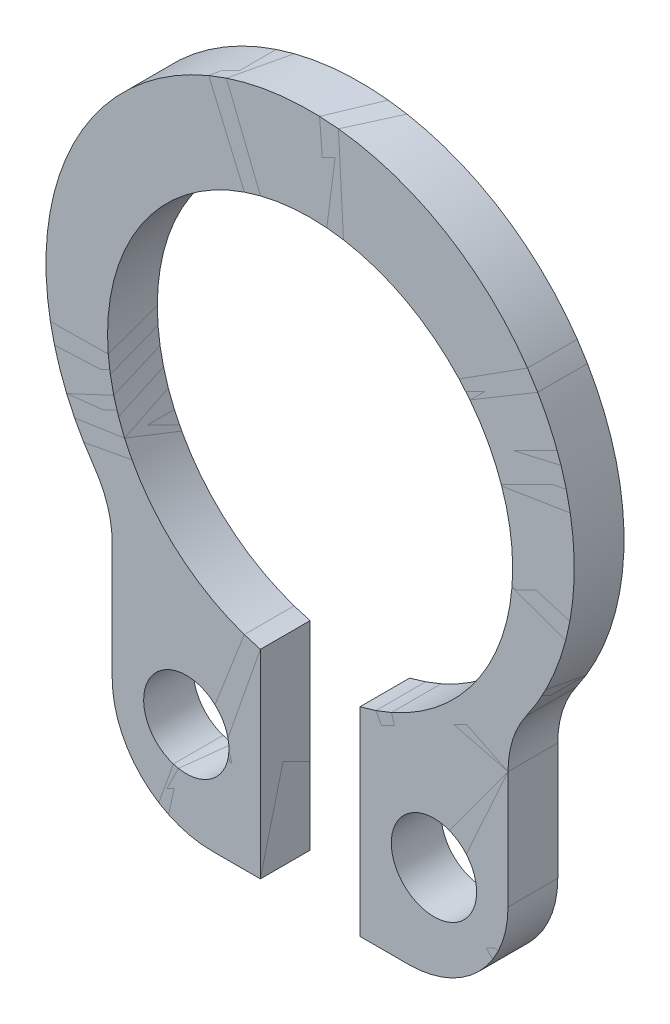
ISO-10303-21;
HEADER;
FILE_DESCRIPTION(('STEP AP214'),'2;1');
FILE_NAME('part.step','',(''),(''),'','','');
FILE_SCHEMA(('AUTOMOTIVE_DESIGN { 1 0 10303 214 1 1 1 1 }'));
ENDSEC;
DATA;
#1=APPLICATION_CONTEXT('core data for automotive mechanical design processes');
#2=APPLICATION_PROTOCOL_DEFINITION('international standard','automotive_design',2000,#1);
#3=PRODUCT_CONTEXT('',#1,'mechanical');
#4=PRODUCT('Part','Part','',(#3));
#5=PRODUCT_RELATED_PRODUCT_CATEGORY('part','',(#4));
#6=PRODUCT_DEFINITION_FORMATION('','',#4);
#7=PRODUCT_DEFINITION_CONTEXT('part definition',#1,'design');
#8=PRODUCT_DEFINITION('design','',#6,#7);
#9=PRODUCT_DEFINITION_SHAPE('','',#8);
#10=(LENGTH_UNIT() NAMED_UNIT(*) SI_UNIT(.MILLI.,.METRE.));
#11=(NAMED_UNIT(*) PLANE_ANGLE_UNIT() SI_UNIT($,.RADIAN.));
#12=(NAMED_UNIT(*) SI_UNIT($,.STERADIAN.) SOLID_ANGLE_UNIT());
#13=UNCERTAINTY_MEASURE_WITH_UNIT(LENGTH_MEASURE(1.E-05),#10,'distance_accuracy_value','');
#14=(GEOMETRIC_REPRESENTATION_CONTEXT(3) GLOBAL_UNCERTAINTY_ASSIGNED_CONTEXT((#13)) GLOBAL_UNIT_ASSIGNED_CONTEXT((#10,
#11,#12)) REPRESENTATION_CONTEXT('',''));
#15=CARTESIAN_POINT('',(0.,0.,0.));
#16=DIRECTION('',(0.,0.,1.));
#17=DIRECTION('',(1.,0.,0.));
#18=AXIS2_PLACEMENT_3D('',#15,#16,#17);
#19=CARTESIAN_POINT('',(-4.18444284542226,-2.51127459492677,0.7));
#20=DIRECTION('',(0.,0.,-1.));
#21=DIRECTION('',(-1.,0.,0.));
#22=AXIS2_PLACEMENT_3D('',#19,#20,#21);
#23=CYLINDRICAL_SURFACE('',#22,1.4);
#24=CARTESIAN_POINT('',(-4.18444284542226,-2.51127459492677,0.));
#25=DIRECTION('',(0.,0.,1.));
#26=DIRECTION('',(1.,0.,0.));
#27=AXIS2_PLACEMENT_3D('',#24,#25,#26);
#28=CIRCLE('',#27,1.4);
#29=CARTESIAN_POINT('',(-2.78444284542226,-2.51127459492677,0.));
#30=VERTEX_POINT('',#29);
#31=CARTESIAN_POINT('',(-3.03951385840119,-1.70558382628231,0.));
#32=VERTEX_POINT('',#31);
#33=EDGE_CURVE('P0_E459',#30,#32,#28,.T.);
#34=ORIENTED_EDGE('',*,*,#33,.F.);
#35=DIRECTION('',(0.,0.,-1.));
#36=VECTOR('',#35,1.);
#37=CARTESIAN_POINT('',(-2.78444284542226,-2.51127459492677,0.7));
#38=LINE('',#37,#36);
#39=CARTESIAN_POINT('',(-2.78444284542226,-2.51127459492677,0.7));
#40=VERTEX_POINT('',#39);
#41=EDGE_CURVE('P0_E364',#40,#30,#38,.T.);
#42=ORIENTED_EDGE('',*,*,#41,.F.);
#43=CARTESIAN_POINT('',(-4.18444284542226,-2.51127459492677,0.7));
#44=DIRECTION('',(0.,0.,1.));
#45=DIRECTION('',(1.,0.,0.));
#46=AXIS2_PLACEMENT_3D('',#43,#44,#45);
#47=CIRCLE('',#46,1.4);
#48=CARTESIAN_POINT('',(-3.03951385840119,-1.70558382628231,0.7));
#49=VERTEX_POINT('',#48);
#50=EDGE_CURVE('P0_E489',#40,#49,#47,.T.);
#51=ORIENTED_EDGE('',*,*,#50,.T.);
#52=DIRECTION('',(0.,0.,-1.));
#53=VECTOR('',#52,1.);
#54=CARTESIAN_POINT('',(-3.03951385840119,-1.70558382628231,0.7));
#55=LINE('',#54,#53);
#56=EDGE_CURVE('P0_E11',#49,#32,#55,.T.);
#57=ORIENTED_EDGE('',*,*,#56,.T.);
#58=EDGE_LOOP('',(#34,#42,#51,#57));
#59=FACE_BOUND('',#58,.T.);
#60=ADVANCED_FACE('P0_F350',(#59),#23,.F.);
#61=CARTESIAN_POINT('',(0.,0.433333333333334,0.7));
#62=DIRECTION('',(0.,0.,-1.));
#63=DIRECTION('',(-1.,0.,0.));
#64=AXIS2_PLACEMENT_3D('',#61,#62,#63);
#65=CYLINDRICAL_SURFACE('',#64,3.71666666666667);
#66=CARTESIAN_POINT('',(0.,0.433333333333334,0.));
#67=DIRECTION('',(0.,0.,1.));
#68=DIRECTION('',(1.,0.,0.));
#69=AXIS2_PLACEMENT_3D('',#66,#67,#68);
#70=CIRCLE('',#69,3.71666666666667);
#71=CARTESIAN_POINT('',(3.03951385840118,-1.70558382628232,0.));
#72=VERTEX_POINT('',#71);
#73=EDGE_CURVE('P0_E441',#72,#32,#70,.T.);
#74=ORIENTED_EDGE('',*,*,#73,.T.);
#75=ORIENTED_EDGE('',*,*,#56,.F.);
#76=CARTESIAN_POINT('',(0.,0.433333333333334,0.7));
#77=DIRECTION('',(0.,0.,1.));
#78=DIRECTION('',(1.,0.,0.));
#79=AXIS2_PLACEMENT_3D('',#76,#77,#78);
#80=CIRCLE('',#79,3.71666666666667);
#81=CARTESIAN_POINT('',(3.03951385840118,-1.70558382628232,0.7));
#82=VERTEX_POINT('',#81);
#83=EDGE_CURVE('P0_E444',#82,#49,#80,.T.);
#84=ORIENTED_EDGE('',*,*,#83,.F.);
#85=DIRECTION('',(0.,0.,-1.));
#86=VECTOR('',#85,1.);
#87=CARTESIAN_POINT('',(3.03951385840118,-1.70558382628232,0.7));
#88=LINE('',#87,#86);
#89=EDGE_CURVE('P0_E353',#82,#72,#88,.T.);
#90=ORIENTED_EDGE('',*,*,#89,.T.);
#91=EDGE_LOOP('',(#74,#75,#84,#90));
#92=FACE_BOUND('',#91,.T.);
#93=ADVANCED_FACE('P0_F439',(#92),#65,.T.);
#94=CARTESIAN_POINT('',(4.18444284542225,-2.51127459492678,0.7));
#95=DIRECTION('',(0.,0.,-1.));
#96=DIRECTION('',(-1.,0.,0.));
#97=AXIS2_PLACEMENT_3D('',#94,#95,#96);
#98=CYLINDRICAL_SURFACE('',#97,1.4);
#99=CARTESIAN_POINT('',(4.18444284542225,-2.51127459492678,0.));
#100=DIRECTION('',(0.,0.,1.));
#101=DIRECTION('',(1.,0.,0.));
#102=AXIS2_PLACEMENT_3D('',#99,#100,#101);
#103=CIRCLE('',#102,1.4);
#104=CARTESIAN_POINT('',(2.78444284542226,-2.51127459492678,0.));
#105=VERTEX_POINT('',#104);
#106=EDGE_CURVE('P0_E450',#72,#105,#103,.T.);
#107=ORIENTED_EDGE('',*,*,#106,.F.);
#108=ORIENTED_EDGE('',*,*,#89,.F.);
#109=CARTESIAN_POINT('',(4.18444284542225,-2.51127459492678,0.7));
#110=DIRECTION('',(0.,0.,1.));
#111=DIRECTION('',(1.,0.,0.));
#112=AXIS2_PLACEMENT_3D('',#109,#110,#111);
#113=CIRCLE('',#112,1.4);
#114=CARTESIAN_POINT('',(2.78444284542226,-2.51127459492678,0.7));
#115=VERTEX_POINT('',#114);
#116=EDGE_CURVE('P0_E492',#82,#115,#113,.T.);
#117=ORIENTED_EDGE('',*,*,#116,.T.);
#118=DIRECTION('',(0.,0.,-1.));
#119=VECTOR('',#118,1.);
#120=CARTESIAN_POINT('',(2.78444284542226,-2.51127459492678,0.7));
#121=LINE('',#120,#119);
#122=EDGE_CURVE('P0_E448',#115,#105,#121,.T.);
#123=ORIENTED_EDGE('',*,*,#122,.T.);
#124=EDGE_LOOP('',(#107,#108,#117,#123));
#125=FACE_BOUND('',#124,.T.);
#126=ADVANCED_FACE('P0_F451',(#125),#98,.F.);
#127=CARTESIAN_POINT('',(2.78444284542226,-4.16,0.7));
#128=DIRECTION('',(-1.,0.,0.));
#129=DIRECTION('',(0.,0.,1.));
#130=AXIS2_PLACEMENT_3D('',#127,#128,#129);
#131=PLANE('',#130);
#132=DIRECTION('',(0.,1.,0.));
#133=VECTOR('',#132,1.);
#134=CARTESIAN_POINT('',(2.78444284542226,-4.16,0.));
#135=LINE('',#134,#133);
#136=CARTESIAN_POINT('',(2.78444284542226,-4.16,0.));
#137=VERTEX_POINT('',#136);
#138=EDGE_CURVE('P0_E455',#137,#105,#135,.T.);
#139=ORIENTED_EDGE('',*,*,#138,.T.);
#140=ORIENTED_EDGE('',*,*,#122,.F.);
#141=DIRECTION('',(0.,1.,0.));
#142=VECTOR('',#141,1.);
#143=CARTESIAN_POINT('',(2.78444284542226,-4.16,0.7));
#144=LINE('',#143,#142);
#145=CARTESIAN_POINT('',(2.78444284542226,-4.16,0.7));
#146=VERTEX_POINT('',#145);
#147=EDGE_CURVE('P0_E494',#146,#115,#144,.T.);
#148=ORIENTED_EDGE('',*,*,#147,.F.);
#149=DIRECTION('',(0.,0.,-1.));
#150=VECTOR('',#149,1.);
#151=CARTESIAN_POINT('',(2.78444284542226,-4.16,0.7));
#152=LINE('',#151,#150);
#153=EDGE_CURVE('P0_E536',#146,#137,#152,.T.);
#154=ORIENTED_EDGE('',*,*,#153,.T.);
#155=EDGE_LOOP('',(#139,#140,#148,#154));
#156=FACE_BOUND('',#155,.T.);
#157=ADVANCED_FACE('P0_F540',(#156),#131,.F.);
#158=CARTESIAN_POINT('',(1.38444284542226,-4.16,0.7));
#159=DIRECTION('',(0.,0.,-1.));
#160=DIRECTION('',(-1.,0.,0.));
#161=AXIS2_PLACEMENT_3D('',#158,#159,#160);
#162=CYLINDRICAL_SURFACE('',#161,1.4);
#163=CARTESIAN_POINT('',(1.38444284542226,-4.16,0.));
#164=DIRECTION('',(0.,0.,1.));
#165=DIRECTION('',(1.,0.,0.));
#166=AXIS2_PLACEMENT_3D('',#163,#164,#165);
#167=CIRCLE('',#166,1.4);
#168=CARTESIAN_POINT('',(1.38444284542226,-5.56,0.));
#169=VERTEX_POINT('',#168);
#170=EDGE_CURVE('P0_E467',#169,#137,#167,.T.);
#171=ORIENTED_EDGE('',*,*,#170,.T.);
#172=ORIENTED_EDGE('',*,*,#153,.F.);
#173=CARTESIAN_POINT('',(1.38444284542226,-4.16,0.7));
#174=DIRECTION('',(0.,0.,1.));
#175=DIRECTION('',(1.,0.,0.));
#176=AXIS2_PLACEMENT_3D('',#173,#174,#175);
#177=CIRCLE('',#176,1.4);
#178=CARTESIAN_POINT('',(1.38444284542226,-5.56,0.7));
#179=VERTEX_POINT('',#178);
#180=EDGE_CURVE('P0_E497',#179,#146,#177,.T.);
#181=ORIENTED_EDGE('',*,*,#180,.F.);
#182=DIRECTION('',(0.,0.,-1.));
#183=VECTOR('',#182,1.);
#184=CARTESIAN_POINT('',(1.38444284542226,-5.56,0.7));
#185=LINE('',#184,#183);
#186=EDGE_CURVE('P0_E534',#179,#169,#185,.T.);
#187=ORIENTED_EDGE('',*,*,#186,.T.);
#188=EDGE_LOOP('',(#171,#172,#181,#187));
#189=FACE_BOUND('',#188,.T.);
#190=ADVANCED_FACE('P0_F544',(#189),#162,.T.);
#191=CARTESIAN_POINT('',(0.7,-5.56,0.7));
#192=DIRECTION('',(0.,1.,0.));
#193=DIRECTION('',(-1.,0.,0.));
#194=AXIS2_PLACEMENT_3D('',#191,#192,#193);
#195=PLANE('',#194);
#196=DIRECTION('',(1.,0.,0.));
#197=VECTOR('',#196,1.);
#198=CARTESIAN_POINT('',(0.7,-5.56,0.));
#199=LINE('',#198,#197);
#200=CARTESIAN_POINT('',(0.7,-5.56,0.));
#201=VERTEX_POINT('',#200);
#202=EDGE_CURVE('P0_E470',#201,#169,#199,.T.);
#203=ORIENTED_EDGE('',*,*,#202,.T.);
#204=ORIENTED_EDGE('',*,*,#186,.F.);
#205=DIRECTION('',(1.,0.,0.));
#206=VECTOR('',#205,1.);
#207=CARTESIAN_POINT('',(0.7,-5.56,0.7));
#208=LINE('',#207,#206);
#209=CARTESIAN_POINT('',(0.7,-5.56,0.7));
#210=VERTEX_POINT('',#209);
#211=EDGE_CURVE('P0_E500',#210,#179,#208,.T.);
#212=ORIENTED_EDGE('',*,*,#211,.F.);
#213=DIRECTION('',(0.,0.,-1.));
#214=VECTOR('',#213,1.);
#215=CARTESIAN_POINT('',(0.7,-5.56,0.7));
#216=LINE('',#215,#214);
#217=EDGE_CURVE('P0_E532',#210,#201,#216,.T.);
#218=ORIENTED_EDGE('',*,*,#217,.T.);
#219=EDGE_LOOP('',(#203,#204,#212,#218));
#220=FACE_BOUND('',#219,.T.);
#221=ADVANCED_FACE('P0_F548',(#220),#195,.F.);
#222=CARTESIAN_POINT('',(0.7,-5.56,0.7));
#223=DIRECTION('',(-1.,0.,0.));
#224=DIRECTION('',(0.,-1.,0.));
#225=AXIS2_PLACEMENT_3D('',#222,#223,#224);
#226=PLANE('',#225);
#227=DIRECTION('',(0.,1.,0.));
#228=VECTOR('',#227,1.);
#229=CARTESIAN_POINT('',(0.7,-5.56,0.));
#230=LINE('',#229,#228);
#231=CARTESIAN_POINT('',(0.7,-2.76269795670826,0.));
#232=VERTEX_POINT('',#231);
#233=EDGE_CURVE('P0_E473',#201,#232,#230,.T.);
#234=ORIENTED_EDGE('',*,*,#233,.F.);
#235=ORIENTED_EDGE('',*,*,#217,.F.);
#236=DIRECTION('',(0.,1.,0.));
#237=VECTOR('',#236,1.);
#238=CARTESIAN_POINT('',(0.7,-5.56,0.7));
#239=LINE('',#238,#237);
#240=CARTESIAN_POINT('',(0.7,-2.76269795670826,0.7));
#241=VERTEX_POINT('',#240);
#242=EDGE_CURVE('P0_E503',#210,#241,#239,.T.);
#243=ORIENTED_EDGE('',*,*,#242,.T.);
#244=DIRECTION('',(0.,0.,-1.));
#245=VECTOR('',#244,1.);
#246=CARTESIAN_POINT('',(0.7,-2.76269795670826,0.7));
#247=LINE('',#246,#245);
#248=EDGE_CURVE('P0_E530',#241,#232,#247,.T.);
#249=ORIENTED_EDGE('',*,*,#248,.T.);
#250=EDGE_LOOP('',(#234,#235,#243,#249));
#251=FACE_BOUND('',#250,.T.);
#252=ADVANCED_FACE('P0_F552',(#251),#226,.T.);
#253=CARTESIAN_POINT('',(0.,0.,0.7));
#254=DIRECTION('',(0.,0.,-1.));
#255=DIRECTION('',(-1.,0.,0.));
#256=AXIS2_PLACEMENT_3D('',#253,#254,#255);
#257=CYLINDRICAL_SURFACE('',#256,2.85);
#258=CARTESIAN_POINT('',(0.,0.,0.));
#259=DIRECTION('',(0.,0.,1.));
#260=DIRECTION('',(1.,0.,0.));
#261=AXIS2_PLACEMENT_3D('',#258,#259,#260);
#262=CIRCLE('',#261,2.85);
#263=CARTESIAN_POINT('',(-0.7,-2.76269795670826,0.));
#264=VERTEX_POINT('',#263);
#265=EDGE_CURVE('P0_E476',#232,#264,#262,.T.);
#266=ORIENTED_EDGE('',*,*,#265,.F.);
#267=ORIENTED_EDGE('',*,*,#248,.F.);
#268=CARTESIAN_POINT('',(0.,0.,0.7));
#269=DIRECTION('',(0.,0.,1.));
#270=DIRECTION('',(1.,0.,0.));
#271=AXIS2_PLACEMENT_3D('',#268,#269,#270);
#272=CIRCLE('',#271,2.85);
#273=CARTESIAN_POINT('',(-0.7,-2.76269795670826,0.7));
#274=VERTEX_POINT('',#273);
#275=EDGE_CURVE('P0_E506',#241,#274,#272,.T.);
#276=ORIENTED_EDGE('',*,*,#275,.T.);
#277=DIRECTION('',(0.,0.,-1.));
#278=VECTOR('',#277,1.);
#279=CARTESIAN_POINT('',(-0.7,-2.76269795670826,0.7));
#280=LINE('',#279,#278);
#281=EDGE_CURVE('P0_E528',#274,#264,#280,.T.);
#282=ORIENTED_EDGE('',*,*,#281,.T.);
#283=EDGE_LOOP('',(#266,#267,#276,#282));
#284=FACE_BOUND('',#283,.T.);
#285=ADVANCED_FACE('P0_F556',(#284),#257,.F.);
#286=CARTESIAN_POINT('',(-0.7,-5.56,0.7));
#287=DIRECTION('',(-1.,0.,0.));
#288=DIRECTION('',(0.,-1.,0.));
#289=AXIS2_PLACEMENT_3D('',#286,#287,#288);
#290=PLANE('',#289);
#291=DIRECTION('',(0.,1.,0.));
#292=VECTOR('',#291,1.);
#293=CARTESIAN_POINT('',(-0.7,-5.56,0.));
#294=LINE('',#293,#292);
#295=CARTESIAN_POINT('',(-0.7,-5.56,0.));
#296=VERTEX_POINT('',#295);
#297=EDGE_CURVE('P0_E479',#296,#264,#294,.T.);
#298=ORIENTED_EDGE('',*,*,#297,.T.);
#299=ORIENTED_EDGE('',*,*,#281,.F.);
#300=DIRECTION('',(0.,1.,0.));
#301=VECTOR('',#300,1.);
#302=CARTESIAN_POINT('',(-0.7,-5.56,0.7));
#303=LINE('',#302,#301);
#304=CARTESIAN_POINT('',(-0.7,-5.56,0.7));
#305=VERTEX_POINT('',#304);
#306=EDGE_CURVE('P0_E509',#305,#274,#303,.T.);
#307=ORIENTED_EDGE('',*,*,#306,.F.);
#308=DIRECTION('',(0.,0.,-1.));
#309=VECTOR('',#308,1.);
#310=CARTESIAN_POINT('',(-0.7,-5.56,0.7));
#311=LINE('',#310,#309);
#312=EDGE_CURVE('P0_E526',#305,#296,#311,.T.);
#313=ORIENTED_EDGE('',*,*,#312,.T.);
#314=EDGE_LOOP('',(#298,#299,#307,#313));
#315=FACE_BOUND('',#314,.T.);
#316=ADVANCED_FACE('P0_F561',(#315),#290,.F.);
#317=CARTESIAN_POINT('',(-1.38444284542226,-5.56,0.7));
#318=DIRECTION('',(0.,1.,0.));
#319=DIRECTION('',(-1.,0.,0.));
#320=AXIS2_PLACEMENT_3D('',#317,#318,#319);
#321=PLANE('',#320);
#322=DIRECTION('',(1.,0.,0.));
#323=VECTOR('',#322,1.);
#324=CARTESIAN_POINT('',(-1.38444284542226,-5.56,0.));
#325=LINE('',#324,#323);
#326=CARTESIAN_POINT('',(-1.38444284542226,-5.56,0.));
#327=VERTEX_POINT('',#326);
#328=EDGE_CURVE('P0_E482',#327,#296,#325,.T.);
#329=ORIENTED_EDGE('',*,*,#328,.T.);
#330=ORIENTED_EDGE('',*,*,#312,.F.);
#331=DIRECTION('',(1.,0.,0.));
#332=VECTOR('',#331,1.);
#333=CARTESIAN_POINT('',(-1.38444284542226,-5.56,0.7));
#334=LINE('',#333,#332);
#335=CARTESIAN_POINT('',(-1.38444284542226,-5.56,0.7));
#336=VERTEX_POINT('',#335);
#337=EDGE_CURVE('P0_E512',#336,#305,#334,.T.);
#338=ORIENTED_EDGE('',*,*,#337,.F.);
#339=DIRECTION('',(0.,0.,-1.));
#340=VECTOR('',#339,1.);
#341=CARTESIAN_POINT('',(-1.38444284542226,-5.56,0.7));
#342=LINE('',#341,#340);
#343=EDGE_CURVE('P0_E524',#336,#327,#342,.T.);
#344=ORIENTED_EDGE('',*,*,#343,.T.);
#345=EDGE_LOOP('',(#329,#330,#338,#344));
#346=FACE_BOUND('',#345,.T.);
#347=ADVANCED_FACE('P0_F565',(#346),#321,.F.);
#348=CARTESIAN_POINT('',(-1.38444284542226,-4.16,0.7));
#349=DIRECTION('',(0.,0.,-1.));
#350=DIRECTION('',(-1.,0.,0.));
#351=AXIS2_PLACEMENT_3D('',#348,#349,#350);
#352=CYLINDRICAL_SURFACE('',#351,1.4);
#353=CARTESIAN_POINT('',(-1.38444284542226,-4.16,0.));
#354=DIRECTION('',(0.,0.,1.));
#355=DIRECTION('',(1.,0.,0.));
#356=AXIS2_PLACEMENT_3D('',#353,#354,#355);
#357=CIRCLE('',#356,1.4);
#358=CARTESIAN_POINT('',(-2.78444284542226,-4.16,0.));
#359=VERTEX_POINT('',#358);
#360=EDGE_CURVE('P0_E485',#359,#327,#357,.T.);
#361=ORIENTED_EDGE('',*,*,#360,.T.);
#362=ORIENTED_EDGE('',*,*,#343,.F.);
#363=CARTESIAN_POINT('',(-1.38444284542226,-4.16,0.7));
#364=DIRECTION('',(0.,0.,1.));
#365=DIRECTION('',(1.,0.,0.));
#366=AXIS2_PLACEMENT_3D('',#363,#364,#365);
#367=CIRCLE('',#366,1.4);
#368=CARTESIAN_POINT('',(-2.78444284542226,-4.16,0.7));
#369=VERTEX_POINT('',#368);
#370=EDGE_CURVE('P0_E515',#369,#336,#367,.T.);
#371=ORIENTED_EDGE('',*,*,#370,.F.);
#372=DIRECTION('',(0.,0.,-1.));
#373=VECTOR('',#372,1.);
#374=CARTESIAN_POINT('',(-2.78444284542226,-4.16,0.7));
#375=LINE('',#374,#373);
#376=EDGE_CURVE('P0_E371',#369,#359,#375,.T.);
#377=ORIENTED_EDGE('',*,*,#376,.T.);
#378=EDGE_LOOP('',(#361,#362,#371,#377));
#379=FACE_BOUND('',#378,.T.);
#380=ADVANCED_FACE('P0_F567',(#379),#352,.T.);
#381=CARTESIAN_POINT('',(-2.78444284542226,-2.51127459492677,0.7));
#382=DIRECTION('',(1.,0.,0.));
#383=DIRECTION('',(0.,1.,0.));
#384=AXIS2_PLACEMENT_3D('',#381,#382,#383);
#385=PLANE('',#384);
#386=DIRECTION('',(0.,-1.,0.));
#387=VECTOR('',#386,1.);
#388=CARTESIAN_POINT('',(-2.78444284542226,-2.51127459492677,0.));
#389=LINE('',#388,#387);
#390=EDGE_CURVE('P0_E488',#30,#359,#389,.T.);
#391=ORIENTED_EDGE('',*,*,#390,.T.);
#392=ORIENTED_EDGE('',*,*,#376,.F.);
#393=DIRECTION('',(0.,-1.,0.));
#394=VECTOR('',#393,1.);
#395=CARTESIAN_POINT('',(-2.78444284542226,-2.51127459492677,0.7));
#396=LINE('',#395,#394);
#397=EDGE_CURVE('P0_E518',#40,#369,#396,.T.);
#398=ORIENTED_EDGE('',*,*,#397,.F.);
#399=ORIENTED_EDGE('',*,*,#41,.T.);
#400=EDGE_LOOP('',(#391,#392,#398,#399));
#401=FACE_BOUND('',#400,.T.);
#402=ADVANCED_FACE('P0_F571',(#401),#385,.F.);
#403=CARTESIAN_POINT('',(-4.18444284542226,-2.51127459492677,0.7));
#404=DIRECTION('',(0.,0.,1.));
#405=DIRECTION('',(1.,0.,0.));
#406=AXIS2_PLACEMENT_3D('',#403,#404,#405);
#407=PLANE('',#406);
#408=CARTESIAN_POINT('',(-1.74222142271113,-4.2,0.7));
#409=DIRECTION('',(0.,0.,-1.));
#410=DIRECTION('',(0.,1.,0.));
#411=AXIS2_PLACEMENT_3D('',#408,#409,#410);
#412=CIRCLE('',#411,0.6);
#413=CARTESIAN_POINT('',(-1.74222142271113,-3.6,0.7));
#414=VERTEX_POINT('',#413);
#415=EDGE_CURVE('P0_E645',#414,#414,#412,.T.);
#416=ORIENTED_EDGE('',*,*,#415,.T.);
#417=EDGE_LOOP('',(#416));
#418=FACE_BOUND('',#417,.T.);
#419=CARTESIAN_POINT('',(1.74222142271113,-4.2,0.7));
#420=DIRECTION('',(0.,0.,-1.));
#421=DIRECTION('',(0.,1.,0.));
#422=AXIS2_PLACEMENT_3D('',#419,#420,#421);
#423=CIRCLE('',#422,0.6);
#424=CARTESIAN_POINT('',(1.74222142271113,-3.6,0.7));
#425=VERTEX_POINT('',#424);
#426=EDGE_CURVE('P0_E461',#425,#425,#423,.T.);
#427=ORIENTED_EDGE('',*,*,#426,.T.);
#428=EDGE_LOOP('',(#427));
#429=FACE_BOUND('',#428,.T.);
#430=ORIENTED_EDGE('',*,*,#50,.F.);
#431=ORIENTED_EDGE('',*,*,#397,.T.);
#432=ORIENTED_EDGE('',*,*,#370,.T.);
#433=ORIENTED_EDGE('',*,*,#337,.T.);
#434=ORIENTED_EDGE('',*,*,#306,.T.);
#435=ORIENTED_EDGE('',*,*,#275,.F.);
#436=ORIENTED_EDGE('',*,*,#242,.F.);
#437=ORIENTED_EDGE('',*,*,#211,.T.);
#438=ORIENTED_EDGE('',*,*,#180,.T.);
#439=ORIENTED_EDGE('',*,*,#147,.T.);
#440=ORIENTED_EDGE('',*,*,#116,.F.);
#441=ORIENTED_EDGE('',*,*,#83,.T.);
#442=EDGE_LOOP('',(#430,#431,#432,#433,#434,#435,#436,#437,#438,#439,#440,#441));
#443=FACE_BOUND('',#442,.T.);
#444=ADVANCED_FACE('P0_F570',(#418,#429,#443),#407,.T.);
#445=CARTESIAN_POINT('',(-4.18444284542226,-2.51127459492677,0.));
#446=DIRECTION('',(0.,0.,1.));
#447=DIRECTION('',(1.,0.,0.));
#448=AXIS2_PLACEMENT_3D('',#445,#446,#447);
#449=PLANE('',#448);
#450=CARTESIAN_POINT('',(-1.74222142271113,-4.2,0.));
#451=DIRECTION('',(0.,0.,1.));
#452=DIRECTION('',(0.,1.,0.));
#453=AXIS2_PLACEMENT_3D('',#450,#451,#452);
#454=CIRCLE('',#453,0.6);
#455=CARTESIAN_POINT('',(-1.74222142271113,-3.6,0.));
#456=VERTEX_POINT('',#455);
#457=EDGE_CURVE('P0_E648',#456,#456,#454,.T.);
#458=ORIENTED_EDGE('',*,*,#457,.T.);
#459=EDGE_LOOP('',(#458));
#460=FACE_BOUND('',#459,.T.);
#461=CARTESIAN_POINT('',(1.74222142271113,-4.2,0.));
#462=DIRECTION('',(0.,0.,1.));
#463=DIRECTION('',(0.,1.,0.));
#464=AXIS2_PLACEMENT_3D('',#461,#462,#463);
#465=CIRCLE('',#464,0.6);
#466=CARTESIAN_POINT('',(1.74222142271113,-3.6,0.));
#467=VERTEX_POINT('',#466);
#468=EDGE_CURVE('P0_E650',#467,#467,#465,.T.);
#469=ORIENTED_EDGE('',*,*,#468,.T.);
#470=EDGE_LOOP('',(#469));
#471=FACE_BOUND('',#470,.T.);
#472=ORIENTED_EDGE('',*,*,#33,.T.);
#473=ORIENTED_EDGE('',*,*,#73,.F.);
#474=ORIENTED_EDGE('',*,*,#106,.T.);
#475=ORIENTED_EDGE('',*,*,#138,.F.);
#476=ORIENTED_EDGE('',*,*,#170,.F.);
#477=ORIENTED_EDGE('',*,*,#202,.F.);
#478=ORIENTED_EDGE('',*,*,#233,.T.);
#479=ORIENTED_EDGE('',*,*,#265,.T.);
#480=ORIENTED_EDGE('',*,*,#297,.F.);
#481=ORIENTED_EDGE('',*,*,#328,.F.);
#482=ORIENTED_EDGE('',*,*,#360,.F.);
#483=ORIENTED_EDGE('',*,*,#390,.F.);
#484=EDGE_LOOP('',(#472,#473,#474,#475,#476,#477,#478,#479,#480,#481,#482,#483));
#485=FACE_BOUND('',#484,.T.);
#486=ADVANCED_FACE('P0_F457',(#460,#471,#485),#449,.F.);
#487=CARTESIAN_POINT('',(1.74222142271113,-4.2,0.));
#488=DIRECTION('',(0.,0.,1.));
#489=DIRECTION('',(0.,1.,0.));
#490=AXIS2_PLACEMENT_3D('',#487,#488,#489);
#491=CYLINDRICAL_SURFACE('',#490,0.6);
#492=ORIENTED_EDGE('',*,*,#426,.F.);
#493=EDGE_LOOP('',(#492));
#494=FACE_BOUND('',#493,.T.);
#495=ORIENTED_EDGE('',*,*,#468,.F.);
#496=EDGE_LOOP('',(#495));
#497=FACE_BOUND('',#496,.T.);
#498=ADVANCED_FACE('P0_F624',(#494,#497),#491,.F.);
#499=CARTESIAN_POINT('',(-1.74222142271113,-4.2,0.));
#500=DIRECTION('',(0.,0.,1.));
#501=DIRECTION('',(0.,1.,0.));
#502=AXIS2_PLACEMENT_3D('',#499,#500,#501);
#503=CYLINDRICAL_SURFACE('',#502,0.6);
#504=ORIENTED_EDGE('',*,*,#415,.F.);
#505=EDGE_LOOP('',(#504));
#506=FACE_BOUND('',#505,.T.);
#507=ORIENTED_EDGE('',*,*,#457,.F.);
#508=EDGE_LOOP('',(#507));
#509=FACE_BOUND('',#508,.T.);
#510=ADVANCED_FACE('P0_F632',(#506,#509),#503,.F.);
#511=CLOSED_SHELL('',(#60,#93,#126,#157,#190,#221,#252,#285,#316,#347,#380,#402,#444,#486,#498,#510));
#512=MANIFOLD_SOLID_BREP('P0_B2',#511);
#513=CARTESIAN_POINT('',(-4.18444284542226,-2.51127459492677,0.7));
#514=DIRECTION('',(0.,0.,-1.));
#515=DIRECTION('',(-1.,0.,0.));
#516=AXIS2_PLACEMENT_3D('',#513,#514,#515);
#517=CYLINDRICAL_SURFACE('',#516,1.4);
#518=CARTESIAN_POINT('',(-4.18444284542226,-2.51127459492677,0.));
#519=DIRECTION('',(0.,0.,1.));
#520=DIRECTION('',(1.,0.,0.));
#521=AXIS2_PLACEMENT_3D('',#518,#519,#520);
#522=CIRCLE('',#521,1.4);
#523=CARTESIAN_POINT('',(-2.78444284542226,-2.51127459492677,0.));
#524=VERTEX_POINT('',#523);
#525=CARTESIAN_POINT('',(-3.03951385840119,-1.70558382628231,0.));
#526=VERTEX_POINT('',#525);
#527=EDGE_CURVE('P1_E124',#524,#526,#522,.T.);
#528=ORIENTED_EDGE('',*,*,#527,.F.);
#529=DIRECTION('',(0.,0.,-1.));
#530=VECTOR('',#529,1.);
#531=CARTESIAN_POINT('',(-2.78444284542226,-2.51127459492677,0.7));
#532=LINE('',#531,#530);
#533=CARTESIAN_POINT('',(-2.78444284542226,-2.51127459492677,0.7));
#534=VERTEX_POINT('',#533);
#535=EDGE_CURVE('P1_E29',#534,#524,#532,.T.);
#536=ORIENTED_EDGE('',*,*,#535,.F.);
#537=CARTESIAN_POINT('',(-4.18444284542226,-2.51127459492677,0.7));
#538=DIRECTION('',(0.,0.,1.));
#539=DIRECTION('',(1.,0.,0.));
#540=AXIS2_PLACEMENT_3D('',#537,#538,#539);
#541=CIRCLE('',#540,1.4);
#542=CARTESIAN_POINT('',(-3.03951385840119,-1.70558382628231,0.7));
#543=VERTEX_POINT('',#542);
#544=EDGE_CURVE('P1_E154',#534,#543,#541,.T.);
#545=ORIENTED_EDGE('',*,*,#544,.T.);
#546=DIRECTION('',(0.,0.,-1.));
#547=VECTOR('',#546,1.);
#548=CARTESIAN_POINT('',(-3.03951385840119,-1.70558382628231,0.7));
#549=LINE('',#548,#547);
#550=EDGE_CURVE('P1_E10',#543,#526,#549,.T.);
#551=ORIENTED_EDGE('',*,*,#550,.T.);
#552=EDGE_LOOP('',(#528,#536,#545,#551));
#553=FACE_BOUND('',#552,.T.);
#554=ADVANCED_FACE('P1_F15',(#553),#517,.F.);
#555=CARTESIAN_POINT('',(0.,0.433333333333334,0.7));
#556=DIRECTION('',(0.,0.,-1.));
#557=DIRECTION('',(-1.,0.,0.));
#558=AXIS2_PLACEMENT_3D('',#555,#556,#557);
#559=CYLINDRICAL_SURFACE('',#558,3.71666666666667);
#560=CARTESIAN_POINT('',(0.,0.433333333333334,0.));
#561=DIRECTION('',(0.,0.,1.));
#562=DIRECTION('',(1.,0.,0.));
#563=AXIS2_PLACEMENT_3D('',#560,#561,#562);
#564=CIRCLE('',#563,3.71666666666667);
#565=CARTESIAN_POINT('',(3.03951385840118,-1.70558382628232,0.));
#566=VERTEX_POINT('',#565);
#567=EDGE_CURVE('P1_E106',#566,#526,#564,.T.);
#568=ORIENTED_EDGE('',*,*,#567,.T.);
#569=ORIENTED_EDGE('',*,*,#550,.F.);
#570=CARTESIAN_POINT('',(0.,0.433333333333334,0.7));
#571=DIRECTION('',(0.,0.,1.));
#572=DIRECTION('',(1.,0.,0.));
#573=AXIS2_PLACEMENT_3D('',#570,#571,#572);
#574=CIRCLE('',#573,3.71666666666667);
#575=CARTESIAN_POINT('',(3.03951385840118,-1.70558382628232,0.7));
#576=VERTEX_POINT('',#575);
#577=EDGE_CURVE('P1_E109',#576,#543,#574,.T.);
#578=ORIENTED_EDGE('',*,*,#577,.F.);
#579=DIRECTION('',(0.,0.,-1.));
#580=VECTOR('',#579,1.);
#581=CARTESIAN_POINT('',(3.03951385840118,-1.70558382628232,0.7));
#582=LINE('',#581,#580);
#583=EDGE_CURVE('P1_E18',#576,#566,#582,.T.);
#584=ORIENTED_EDGE('',*,*,#583,.T.);
#585=EDGE_LOOP('',(#568,#569,#578,#584));
#586=FACE_BOUND('',#585,.T.);
#587=ADVANCED_FACE('P1_F104',(#586),#559,.T.);
#588=CARTESIAN_POINT('',(4.18444284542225,-2.51127459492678,0.7));
#589=DIRECTION('',(0.,0.,-1.));
#590=DIRECTION('',(-1.,0.,0.));
#591=AXIS2_PLACEMENT_3D('',#588,#589,#590);
#592=CYLINDRICAL_SURFACE('',#591,1.4);
#593=CARTESIAN_POINT('',(4.18444284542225,-2.51127459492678,0.));
#594=DIRECTION('',(0.,0.,1.));
#595=DIRECTION('',(1.,0.,0.));
#596=AXIS2_PLACEMENT_3D('',#593,#594,#595);
#597=CIRCLE('',#596,1.4);
#598=CARTESIAN_POINT('',(2.78444284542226,-2.51127459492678,0.));
#599=VERTEX_POINT('',#598);
#600=EDGE_CURVE('P1_E115',#566,#599,#597,.T.);
#601=ORIENTED_EDGE('',*,*,#600,.F.);
#602=ORIENTED_EDGE('',*,*,#583,.F.);
#603=CARTESIAN_POINT('',(4.18444284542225,-2.51127459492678,0.7));
#604=DIRECTION('',(0.,0.,1.));
#605=DIRECTION('',(1.,0.,0.));
#606=AXIS2_PLACEMENT_3D('',#603,#604,#605);
#607=CIRCLE('',#606,1.4);
#608=CARTESIAN_POINT('',(2.78444284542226,-2.51127459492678,0.7));
#609=VERTEX_POINT('',#608);
#610=EDGE_CURVE('P1_E157',#576,#609,#607,.T.);
#611=ORIENTED_EDGE('',*,*,#610,.T.);
#612=DIRECTION('',(0.,0.,-1.));
#613=VECTOR('',#612,1.);
#614=CARTESIAN_POINT('',(2.78444284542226,-2.51127459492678,0.7));
#615=LINE('',#614,#613);
#616=EDGE_CURVE('P1_E113',#609,#599,#615,.T.);
#617=ORIENTED_EDGE('',*,*,#616,.T.);
#618=EDGE_LOOP('',(#601,#602,#611,#617));
#619=FACE_BOUND('',#618,.T.);
#620=ADVANCED_FACE('P1_F116',(#619),#592,.F.);
#621=CARTESIAN_POINT('',(2.78444284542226,-4.16,0.7));
#622=DIRECTION('',(-1.,0.,0.));
#623=DIRECTION('',(0.,0.,1.));
#624=AXIS2_PLACEMENT_3D('',#621,#622,#623);
#625=PLANE('',#624);
#626=DIRECTION('',(0.,1.,0.));
#627=VECTOR('',#626,1.);
#628=CARTESIAN_POINT('',(2.78444284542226,-4.16,0.));
#629=LINE('',#628,#627);
#630=CARTESIAN_POINT('',(2.78444284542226,-4.16,0.));
#631=VERTEX_POINT('',#630);
#632=EDGE_CURVE('P1_E120',#631,#599,#629,.T.);
#633=ORIENTED_EDGE('',*,*,#632,.T.);
#634=ORIENTED_EDGE('',*,*,#616,.F.);
#635=DIRECTION('',(0.,1.,0.));
#636=VECTOR('',#635,1.);
#637=CARTESIAN_POINT('',(2.78444284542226,-4.16,0.7));
#638=LINE('',#637,#636);
#639=CARTESIAN_POINT('',(2.78444284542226,-4.16,0.7));
#640=VERTEX_POINT('',#639);
#641=EDGE_CURVE('P1_E159',#640,#609,#638,.T.);
#642=ORIENTED_EDGE('',*,*,#641,.F.);
#643=DIRECTION('',(0.,0.,-1.));
#644=VECTOR('',#643,1.);
#645=CARTESIAN_POINT('',(2.78444284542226,-4.16,0.7));
#646=LINE('',#645,#644);
#647=EDGE_CURVE('P1_E201',#640,#631,#646,.T.);
#648=ORIENTED_EDGE('',*,*,#647,.T.);
#649=EDGE_LOOP('',(#633,#634,#642,#648));
#650=FACE_BOUND('',#649,.T.);
#651=ADVANCED_FACE('P1_F205',(#650),#625,.F.);
#652=CARTESIAN_POINT('',(1.38444284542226,-4.16,0.7));
#653=DIRECTION('',(0.,0.,-1.));
#654=DIRECTION('',(-1.,0.,0.));
#655=AXIS2_PLACEMENT_3D('',#652,#653,#654);
#656=CYLINDRICAL_SURFACE('',#655,1.4);
#657=CARTESIAN_POINT('',(1.38444284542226,-4.16,0.));
#658=DIRECTION('',(0.,0.,1.));
#659=DIRECTION('',(1.,0.,0.));
#660=AXIS2_PLACEMENT_3D('',#657,#658,#659);
#661=CIRCLE('',#660,1.4);
#662=CARTESIAN_POINT('',(1.38444284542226,-5.56,0.));
#663=VERTEX_POINT('',#662);
#664=EDGE_CURVE('P1_E132',#663,#631,#661,.T.);
#665=ORIENTED_EDGE('',*,*,#664,.T.);
#666=ORIENTED_EDGE('',*,*,#647,.F.);
#667=CARTESIAN_POINT('',(1.38444284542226,-4.16,0.7));
#668=DIRECTION('',(0.,0.,1.));
#669=DIRECTION('',(1.,0.,0.));
#670=AXIS2_PLACEMENT_3D('',#667,#668,#669);
#671=CIRCLE('',#670,1.4);
#672=CARTESIAN_POINT('',(1.38444284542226,-5.56,0.7));
#673=VERTEX_POINT('',#672);
#674=EDGE_CURVE('P1_E162',#673,#640,#671,.T.);
#675=ORIENTED_EDGE('',*,*,#674,.F.);
#676=DIRECTION('',(0.,0.,-1.));
#677=VECTOR('',#676,1.);
#678=CARTESIAN_POINT('',(1.38444284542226,-5.56,0.7));
#679=LINE('',#678,#677);
#680=EDGE_CURVE('P1_E199',#673,#663,#679,.T.);
#681=ORIENTED_EDGE('',*,*,#680,.T.);
#682=EDGE_LOOP('',(#665,#666,#675,#681));
#683=FACE_BOUND('',#682,.T.);
#684=ADVANCED_FACE('P1_F209',(#683),#656,.T.);
#685=CARTESIAN_POINT('',(0.7,-5.56,0.7));
#686=DIRECTION('',(0.,1.,0.));
#687=DIRECTION('',(-1.,0.,0.));
#688=AXIS2_PLACEMENT_3D('',#685,#686,#687);
#689=PLANE('',#688);
#690=DIRECTION('',(1.,0.,0.));
#691=VECTOR('',#690,1.);
#692=CARTESIAN_POINT('',(0.7,-5.56,0.));
#693=LINE('',#692,#691);
#694=CARTESIAN_POINT('',(0.7,-5.56,0.));
#695=VERTEX_POINT('',#694);
#696=EDGE_CURVE('P1_E135',#695,#663,#693,.T.);
#697=ORIENTED_EDGE('',*,*,#696,.T.);
#698=ORIENTED_EDGE('',*,*,#680,.F.);
#699=DIRECTION('',(1.,0.,0.));
#700=VECTOR('',#699,1.);
#701=CARTESIAN_POINT('',(0.7,-5.56,0.7));
#702=LINE('',#701,#700);
#703=CARTESIAN_POINT('',(0.7,-5.56,0.7));
#704=VERTEX_POINT('',#703);
#705=EDGE_CURVE('P1_E165',#704,#673,#702,.T.);
#706=ORIENTED_EDGE('',*,*,#705,.F.);
#707=DIRECTION('',(0.,0.,-1.));
#708=VECTOR('',#707,1.);
#709=CARTESIAN_POINT('',(0.7,-5.56,0.7));
#710=LINE('',#709,#708);
#711=EDGE_CURVE('P1_E197',#704,#695,#710,.T.);
#712=ORIENTED_EDGE('',*,*,#711,.T.);
#713=EDGE_LOOP('',(#697,#698,#706,#712));
#714=FACE_BOUND('',#713,.T.);
#715=ADVANCED_FACE('P1_F213',(#714),#689,.F.);
#716=CARTESIAN_POINT('',(0.7,-5.56,0.7));
#717=DIRECTION('',(-1.,0.,0.));
#718=DIRECTION('',(0.,-1.,0.));
#719=AXIS2_PLACEMENT_3D('',#716,#717,#718);
#720=PLANE('',#719);
#721=DIRECTION('',(0.,1.,0.));
#722=VECTOR('',#721,1.);
#723=CARTESIAN_POINT('',(0.7,-5.56,0.));
#724=LINE('',#723,#722);
#725=CARTESIAN_POINT('',(0.7,-2.76269795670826,0.));
#726=VERTEX_POINT('',#725);
#727=EDGE_CURVE('P1_E138',#695,#726,#724,.T.);
#728=ORIENTED_EDGE('',*,*,#727,.F.);
#729=ORIENTED_EDGE('',*,*,#711,.F.);
#730=DIRECTION('',(0.,1.,0.));
#731=VECTOR('',#730,1.);
#732=CARTESIAN_POINT('',(0.7,-5.56,0.7));
#733=LINE('',#732,#731);
#734=CARTESIAN_POINT('',(0.7,-2.76269795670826,0.7));
#735=VERTEX_POINT('',#734);
#736=EDGE_CURVE('P1_E168',#704,#735,#733,.T.);
#737=ORIENTED_EDGE('',*,*,#736,.T.);
#738=DIRECTION('',(0.,0.,-1.));
#739=VECTOR('',#738,1.);
#740=CARTESIAN_POINT('',(0.7,-2.76269795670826,0.7));
#741=LINE('',#740,#739);
#742=EDGE_CURVE('P1_E195',#735,#726,#741,.T.);
#743=ORIENTED_EDGE('',*,*,#742,.T.);
#744=EDGE_LOOP('',(#728,#729,#737,#743));
#745=FACE_BOUND('',#744,.T.);
#746=ADVANCED_FACE('P1_F217',(#745),#720,.T.);
#747=CARTESIAN_POINT('',(0.,0.,0.7));
#748=DIRECTION('',(0.,0.,-1.));
#749=DIRECTION('',(-1.,0.,0.));
#750=AXIS2_PLACEMENT_3D('',#747,#748,#749);
#751=CYLINDRICAL_SURFACE('',#750,2.85);
#752=CARTESIAN_POINT('',(0.,0.,0.));
#753=DIRECTION('',(0.,0.,1.));
#754=DIRECTION('',(1.,0.,0.));
#755=AXIS2_PLACEMENT_3D('',#752,#753,#754);
#756=CIRCLE('',#755,2.85);
#757=CARTESIAN_POINT('',(-0.7,-2.76269795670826,0.));
#758=VERTEX_POINT('',#757);
#759=EDGE_CURVE('P1_E141',#726,#758,#756,.T.);
#760=ORIENTED_EDGE('',*,*,#759,.F.);
#761=ORIENTED_EDGE('',*,*,#742,.F.);
#762=CARTESIAN_POINT('',(0.,0.,0.7));
#763=DIRECTION('',(0.,0.,1.));
#764=DIRECTION('',(1.,0.,0.));
#765=AXIS2_PLACEMENT_3D('',#762,#763,#764);
#766=CIRCLE('',#765,2.85);
#767=CARTESIAN_POINT('',(-0.7,-2.76269795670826,0.7));
#768=VERTEX_POINT('',#767);
#769=EDGE_CURVE('P1_E171',#735,#768,#766,.T.);
#770=ORIENTED_EDGE('',*,*,#769,.T.);
#771=DIRECTION('',(0.,0.,-1.));
#772=VECTOR('',#771,1.);
#773=CARTESIAN_POINT('',(-0.7,-2.76269795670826,0.7));
#774=LINE('',#773,#772);
#775=EDGE_CURVE('P1_E193',#768,#758,#774,.T.);
#776=ORIENTED_EDGE('',*,*,#775,.T.);
#777=EDGE_LOOP('',(#760,#761,#770,#776));
#778=FACE_BOUND('',#777,.T.);
#779=ADVANCED_FACE('P1_F221',(#778),#751,.F.);
#780=CARTESIAN_POINT('',(-0.7,-5.56,0.7));
#781=DIRECTION('',(-1.,0.,0.));
#782=DIRECTION('',(0.,-1.,0.));
#783=AXIS2_PLACEMENT_3D('',#780,#781,#782);
#784=PLANE('',#783);
#785=DIRECTION('',(0.,1.,0.));
#786=VECTOR('',#785,1.);
#787=CARTESIAN_POINT('',(-0.7,-5.56,0.));
#788=LINE('',#787,#786);
#789=CARTESIAN_POINT('',(-0.7,-5.56,0.));
#790=VERTEX_POINT('',#789);
#791=EDGE_CURVE('P1_E144',#790,#758,#788,.T.);
#792=ORIENTED_EDGE('',*,*,#791,.T.);
#793=ORIENTED_EDGE('',*,*,#775,.F.);
#794=DIRECTION('',(0.,1.,0.));
#795=VECTOR('',#794,1.);
#796=CARTESIAN_POINT('',(-0.7,-5.56,0.7));
#797=LINE('',#796,#795);
#798=CARTESIAN_POINT('',(-0.7,-5.56,0.7));
#799=VERTEX_POINT('',#798);
#800=EDGE_CURVE('P1_E174',#799,#768,#797,.T.);
#801=ORIENTED_EDGE('',*,*,#800,.F.);
#802=DIRECTION('',(0.,0.,-1.));
#803=VECTOR('',#802,1.);
#804=CARTESIAN_POINT('',(-0.7,-5.56,0.7));
#805=LINE('',#804,#803);
#806=EDGE_CURVE('P1_E191',#799,#790,#805,.T.);
#807=ORIENTED_EDGE('',*,*,#806,.T.);
#808=EDGE_LOOP('',(#792,#793,#801,#807));
#809=FACE_BOUND('',#808,.T.);
#810=ADVANCED_FACE('P1_F226',(#809),#784,.F.);
#811=CARTESIAN_POINT('',(-1.38444284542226,-5.56,0.7));
#812=DIRECTION('',(0.,1.,0.));
#813=DIRECTION('',(-1.,0.,0.));
#814=AXIS2_PLACEMENT_3D('',#811,#812,#813);
#815=PLANE('',#814);
#816=DIRECTION('',(1.,0.,0.));
#817=VECTOR('',#816,1.);
#818=CARTESIAN_POINT('',(-1.38444284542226,-5.56,0.));
#819=LINE('',#818,#817);
#820=CARTESIAN_POINT('',(-1.38444284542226,-5.56,0.));
#821=VERTEX_POINT('',#820);
#822=EDGE_CURVE('P1_E147',#821,#790,#819,.T.);
#823=ORIENTED_EDGE('',*,*,#822,.T.);
#824=ORIENTED_EDGE('',*,*,#806,.F.);
#825=DIRECTION('',(1.,0.,0.));
#826=VECTOR('',#825,1.);
#827=CARTESIAN_POINT('',(-1.38444284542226,-5.56,0.7));
#828=LINE('',#827,#826);
#829=CARTESIAN_POINT('',(-1.38444284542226,-5.56,0.7));
#830=VERTEX_POINT('',#829);
#831=EDGE_CURVE('P1_E177',#830,#799,#828,.T.);
#832=ORIENTED_EDGE('',*,*,#831,.F.);
#833=DIRECTION('',(0.,0.,-1.));
#834=VECTOR('',#833,1.);
#835=CARTESIAN_POINT('',(-1.38444284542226,-5.56,0.7));
#836=LINE('',#835,#834);
#837=EDGE_CURVE('P1_E189',#830,#821,#836,.T.);
#838=ORIENTED_EDGE('',*,*,#837,.T.);
#839=EDGE_LOOP('',(#823,#824,#832,#838));
#840=FACE_BOUND('',#839,.T.);
#841=ADVANCED_FACE('P1_F230',(#840),#815,.F.);
#842=CARTESIAN_POINT('',(-1.38444284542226,-4.16,0.7));
#843=DIRECTION('',(0.,0.,-1.));
#844=DIRECTION('',(-1.,0.,0.));
#845=AXIS2_PLACEMENT_3D('',#842,#843,#844);
#846=CYLINDRICAL_SURFACE('',#845,1.4);
#847=CARTESIAN_POINT('',(-1.38444284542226,-4.16,0.));
#848=DIRECTION('',(0.,0.,1.));
#849=DIRECTION('',(1.,0.,0.));
#850=AXIS2_PLACEMENT_3D('',#847,#848,#849);
#851=CIRCLE('',#850,1.4);
#852=CARTESIAN_POINT('',(-2.78444284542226,-4.16,0.));
#853=VERTEX_POINT('',#852);
#854=EDGE_CURVE('P1_E150',#853,#821,#851,.T.);
#855=ORIENTED_EDGE('',*,*,#854,.T.);
#856=ORIENTED_EDGE('',*,*,#837,.F.);
#857=CARTESIAN_POINT('',(-1.38444284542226,-4.16,0.7));
#858=DIRECTION('',(0.,0.,1.));
#859=DIRECTION('',(1.,0.,0.));
#860=AXIS2_PLACEMENT_3D('',#857,#858,#859);
#861=CIRCLE('',#860,1.4);
#862=CARTESIAN_POINT('',(-2.78444284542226,-4.16,0.7));
#863=VERTEX_POINT('',#862);
#864=EDGE_CURVE('P1_E180',#863,#830,#861,.T.);
#865=ORIENTED_EDGE('',*,*,#864,.F.);
#866=DIRECTION('',(0.,0.,-1.));
#867=VECTOR('',#866,1.);
#868=CARTESIAN_POINT('',(-2.78444284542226,-4.16,0.7));
#869=LINE('',#868,#867);
#870=EDGE_CURVE('P1_E36',#863,#853,#869,.T.);
#871=ORIENTED_EDGE('',*,*,#870,.T.);
#872=EDGE_LOOP('',(#855,#856,#865,#871));
#873=FACE_BOUND('',#872,.T.);
#874=ADVANCED_FACE('P1_F232',(#873),#846,.T.);
#875=CARTESIAN_POINT('',(-2.78444284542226,-2.51127459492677,0.7));
#876=DIRECTION('',(1.,0.,0.));
#877=DIRECTION('',(0.,1.,0.));
#878=AXIS2_PLACEMENT_3D('',#875,#876,#877);
#879=PLANE('',#878);
#880=DIRECTION('',(0.,-1.,0.));
#881=VECTOR('',#880,1.);
#882=CARTESIAN_POINT('',(-2.78444284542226,-2.51127459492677,0.));
#883=LINE('',#882,#881);
#884=EDGE_CURVE('P1_E153',#524,#853,#883,.T.);
#885=ORIENTED_EDGE('',*,*,#884,.T.);
#886=ORIENTED_EDGE('',*,*,#870,.F.);
#887=DIRECTION('',(0.,-1.,0.));
#888=VECTOR('',#887,1.);
#889=CARTESIAN_POINT('',(-2.78444284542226,-2.51127459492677,0.7));
#890=LINE('',#889,#888);
#891=EDGE_CURVE('P1_E183',#534,#863,#890,.T.);
#892=ORIENTED_EDGE('',*,*,#891,.F.);
#893=ORIENTED_EDGE('',*,*,#535,.T.);
#894=EDGE_LOOP('',(#885,#886,#892,#893));
#895=FACE_BOUND('',#894,.T.);
#896=ADVANCED_FACE('P1_F236',(#895),#879,.F.);
#897=CARTESIAN_POINT('',(-4.18444284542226,-2.51127459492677,0.7));
#898=DIRECTION('',(0.,0.,1.));
#899=DIRECTION('',(1.,0.,0.));
#900=AXIS2_PLACEMENT_3D('',#897,#898,#899);
#901=PLANE('',#900);
#902=CARTESIAN_POINT('',(-1.74222142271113,-4.2,0.7));
#903=DIRECTION('',(0.,0.,-1.));
#904=DIRECTION('',(0.,1.,0.));
#905=AXIS2_PLACEMENT_3D('',#902,#903,#904);
#906=CIRCLE('',#905,0.6);
#907=CARTESIAN_POINT('',(-1.74222142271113,-3.6,0.7));
#908=VERTEX_POINT('',#907);
#909=EDGE_CURVE('P1_E260',#908,#908,#906,.T.);
#910=ORIENTED_EDGE('',*,*,#909,.T.);
#911=EDGE_LOOP('',(#910));
#912=FACE_BOUND('',#911,.T.);
#913=CARTESIAN_POINT('',(1.74222142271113,-4.2,0.7));
#914=DIRECTION('',(0.,0.,-1.));
#915=DIRECTION('',(0.,1.,0.));
#916=AXIS2_PLACEMENT_3D('',#913,#914,#915);
#917=CIRCLE('',#916,0.6);
#918=CARTESIAN_POINT('',(1.74222142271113,-3.6,0.7));
#919=VERTEX_POINT('',#918);
#920=EDGE_CURVE('P1_E126',#919,#919,#917,.T.);
#921=ORIENTED_EDGE('',*,*,#920,.T.);
#922=EDGE_LOOP('',(#921));
#923=FACE_BOUND('',#922,.T.);
#924=ORIENTED_EDGE('',*,*,#544,.F.);
#925=ORIENTED_EDGE('',*,*,#891,.T.);
#926=ORIENTED_EDGE('',*,*,#864,.T.);
#927=ORIENTED_EDGE('',*,*,#831,.T.);
#928=ORIENTED_EDGE('',*,*,#800,.T.);
#929=ORIENTED_EDGE('',*,*,#769,.F.);
#930=ORIENTED_EDGE('',*,*,#736,.F.);
#931=ORIENTED_EDGE('',*,*,#705,.T.);
#932=ORIENTED_EDGE('',*,*,#674,.T.);
#933=ORIENTED_EDGE('',*,*,#641,.T.);
#934=ORIENTED_EDGE('',*,*,#610,.F.);
#935=ORIENTED_EDGE('',*,*,#577,.T.);
#936=EDGE_LOOP('',(#924,#925,#926,#927,#928,#929,#930,#931,#932,#933,#934,#935));
#937=FACE_BOUND('',#936,.T.);
#938=ADVANCED_FACE('P1_F235',(#912,#923,#937),#901,.T.);
#939=CARTESIAN_POINT('',(-4.18444284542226,-2.51127459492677,0.));
#940=DIRECTION('',(0.,0.,1.));
#941=DIRECTION('',(1.,0.,0.));
#942=AXIS2_PLACEMENT_3D('',#939,#940,#941);
#943=PLANE('',#942);
#944=CARTESIAN_POINT('',(-1.74222142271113,-4.2,0.));
#945=DIRECTION('',(0.,0.,1.));
#946=DIRECTION('',(0.,1.,0.));
#947=AXIS2_PLACEMENT_3D('',#944,#945,#946);
#948=CIRCLE('',#947,0.6);
#949=CARTESIAN_POINT('',(-1.74222142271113,-3.6,0.));
#950=VERTEX_POINT('',#949);
#951=EDGE_CURVE('P1_E263',#950,#950,#948,.T.);
#952=ORIENTED_EDGE('',*,*,#951,.T.);
#953=EDGE_LOOP('',(#952));
#954=FACE_BOUND('',#953,.T.);
#955=CARTESIAN_POINT('',(1.74222142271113,-4.2,0.));
#956=DIRECTION('',(0.,0.,1.));
#957=DIRECTION('',(0.,1.,0.));
#958=AXIS2_PLACEMENT_3D('',#955,#956,#957);
#959=CIRCLE('',#958,0.6);
#960=CARTESIAN_POINT('',(1.74222142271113,-3.6,0.));
#961=VERTEX_POINT('',#960);
#962=EDGE_CURVE('P1_E265',#961,#961,#959,.T.);
#963=ORIENTED_EDGE('',*,*,#962,.T.);
#964=EDGE_LOOP('',(#963));
#965=FACE_BOUND('',#964,.T.);
#966=ORIENTED_EDGE('',*,*,#527,.T.);
#967=ORIENTED_EDGE('',*,*,#567,.F.);
#968=ORIENTED_EDGE('',*,*,#600,.T.);
#969=ORIENTED_EDGE('',*,*,#632,.F.);
#970=ORIENTED_EDGE('',*,*,#664,.F.);
#971=ORIENTED_EDGE('',*,*,#696,.F.);
#972=ORIENTED_EDGE('',*,*,#727,.T.);
#973=ORIENTED_EDGE('',*,*,#759,.T.);
#974=ORIENTED_EDGE('',*,*,#791,.F.);
#975=ORIENTED_EDGE('',*,*,#822,.F.);
#976=ORIENTED_EDGE('',*,*,#854,.F.);
#977=ORIENTED_EDGE('',*,*,#884,.F.);
#978=EDGE_LOOP('',(#966,#967,#968,#969,#970,#971,#972,#973,#974,#975,#976,#977));
#979=FACE_BOUND('',#978,.T.);
#980=ADVANCED_FACE('P1_F122',(#954,#965,#979),#943,.F.);
#981=CARTESIAN_POINT('',(1.74222142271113,-4.2,0.));
#982=DIRECTION('',(0.,0.,1.));
#983=DIRECTION('',(0.,1.,0.));
#984=AXIS2_PLACEMENT_3D('',#981,#982,#983);
#985=CYLINDRICAL_SURFACE('',#984,0.6);
#986=ORIENTED_EDGE('',*,*,#920,.F.);
#987=EDGE_LOOP('',(#986));
#988=FACE_BOUND('',#987,.T.);
#989=ORIENTED_EDGE('',*,*,#962,.F.);
#990=EDGE_LOOP('',(#989));
#991=FACE_BOUND('',#990,.T.);
#992=ADVANCED_FACE('P1_F251',(#988,#991),#985,.F.);
#993=CARTESIAN_POINT('',(-1.74222142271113,-4.2,0.));
#994=DIRECTION('',(0.,0.,1.));
#995=DIRECTION('',(0.,1.,0.));
#996=AXIS2_PLACEMENT_3D('',#993,#994,#995);
#997=CYLINDRICAL_SURFACE('',#996,0.6);
#998=ORIENTED_EDGE('',*,*,#909,.F.);
#999=EDGE_LOOP('',(#998));
#1000=FACE_BOUND('',#999,.T.);
#1001=ORIENTED_EDGE('',*,*,#951,.F.);
#1002=EDGE_LOOP('',(#1001));
#1003=FACE_BOUND('',#1002,.T.);
#1004=ADVANCED_FACE('P1_F254',(#1000,#1003),#997,.F.);
#1005=CLOSED_SHELL('',(#554,#587,#620,#651,#684,#715,#746,#779,#810,#841,#874,#896,#938,#980,
#992,#1004));
#1006=MANIFOLD_SOLID_BREP('P1_B1',#1005);
#1007=ADVANCED_BREP_SHAPE_REPRESENTATION('',(#18,#512,#1006),#14);
#1008=SHAPE_DEFINITION_REPRESENTATION(#9,#1007);
ENDSEC;
END-ISO-10303-21;
